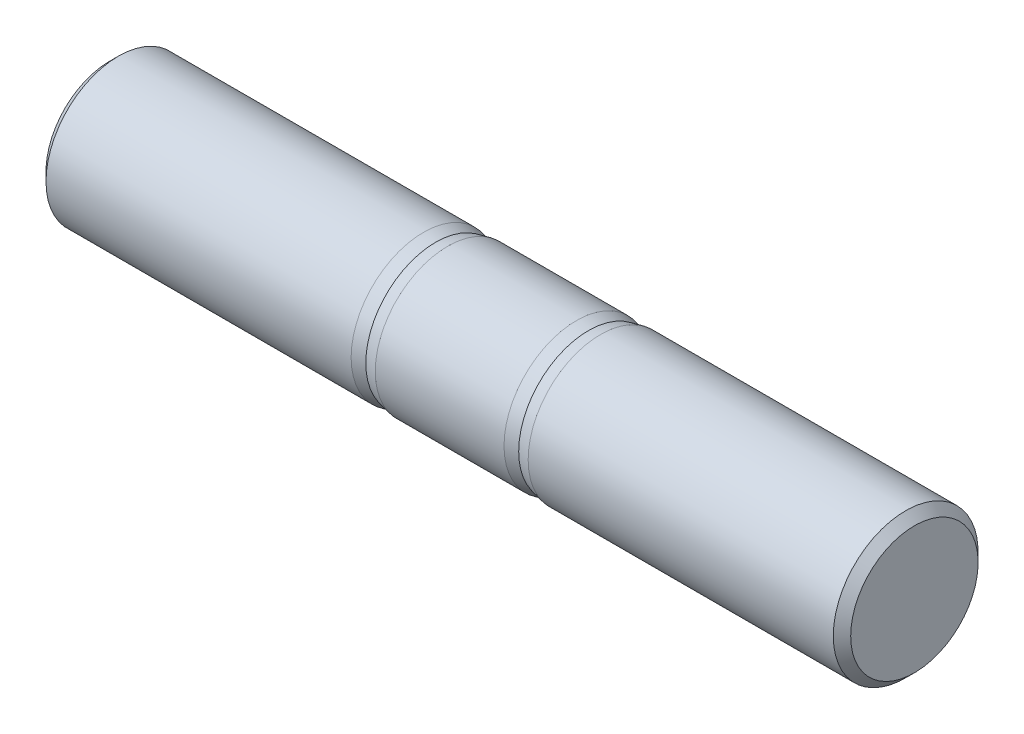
from build123d import *

# Parameters (mm, degrees)
HEADCHAMFER_SIZE = 2.165


with BuildPart() as part:
    # Sketch1 → Base (revolve)
    with BuildSketch(Plane.XY, mode=Mode.PRIVATE) as base_sk:
        Polygon((0, 0), (0, 18), (78, 18), (84, 16.701), (116, 16.701), (122, 18), (200, 18), (200, 0), align=None)
    revolve(base_sk.sketch.rotate(Axis((-1.310841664, 0, 0), (1, 0, 0)), 90), axis=Axis((-1.310841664, 0, 0), (1, 0, 0)))

    # HeadChamfer
    headchamfer_edges = [part.edges().sort_by_distance(p)[0] for p in [
        (200, 0, -18),
        (0, 0, -18),
    ]]
    chamfer(headchamfer_edges, length=HEADCHAMFER_SIZE)

    # Sketch4 → BaseBody (revolve)
    with BuildSketch(Plane.XY, mode=Mode.PRIVATE) as basebody_sk:
        Polygon((78, 16.701), (84, 18), (116, 18), (122, 16.701), align=None)
    revolve(basebody_sk.sketch.rotate(Axis((-7.809086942, 0, 0), (1, 0, 0)), 90), axis=Axis((-7.809086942, 0, 0), (1, 0, 0)))


solid = part.part
